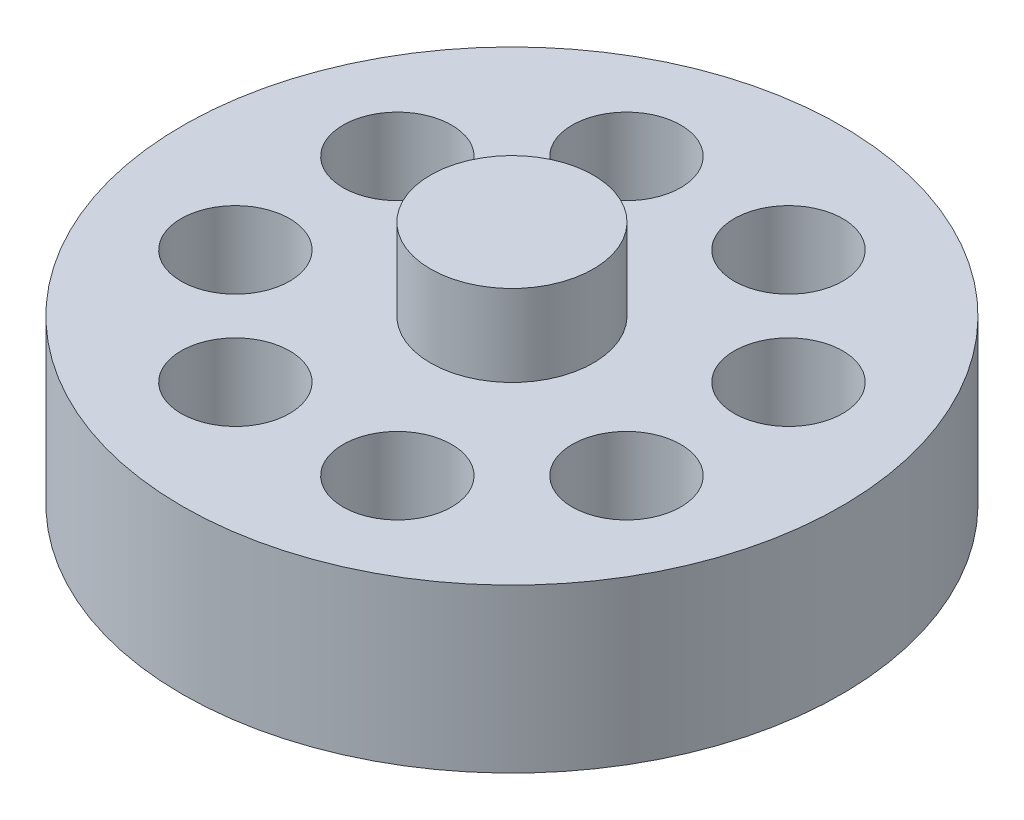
from build123d import *

# Parameters (mm, degrees)
SKETCH1_R           = 60.725
EXTRUDE1_DEPTH      = 15
SKETCH3_R           = 10
CUT_EXTRUDE2_DEPTH  = 88.178272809
EXTRUDE2_DEPTH      = 30
EXTRUDE2_DEPTH_BACK = 30
SKETCH2_R           = 15
CIRPATTERN1_COUNT   = 8


with BuildPart() as part:
    # Sketch1 → Extrude1 (new, symmetric)
    with BuildSketch(Plane(origin=(0, 0, 0), x_dir=(1, 0, 0), z_dir=(0, 1, 0))):
        with Locations(Location((0, 0, 0), (0, 0, 270))):
            Circle(SKETCH1_R)
    extrude(amount=EXTRUDE1_DEPTH, both=True)

    # Sketch3 → Cut-Extrude2 (cut, symmetric)
    with BuildSketch(Plane(origin=(0, 0, 0), x_dir=(1, 0, 0), z_dir=(0, 1, 0))):
        with Locations(Location((-14.924653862, 36.031301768, 0), (0, 0, 270))):
            Circle(SKETCH3_R)
    cut_extrude2 = extrude(amount=CUT_EXTRUDE2_DEPTH, both=True, mode=Mode.SUBTRACT)

    # Sketch2 → Extrude2 (add, two sides: drawn at the far end of the back side and taken through both)
    with BuildSketch(Plane(origin=(0, 0, 0), x_dir=(1, 0, 0), z_dir=(0, 1, 0)).offset(-EXTRUDE2_DEPTH_BACK)):
        with Locations(Location((0, 0, 0), (0, 0, 270))):
            Circle(SKETCH2_R)
    extrude(amount=EXTRUDE2_DEPTH + EXTRUDE2_DEPTH_BACK)

    # CirPattern1: Cut-Extrude2 ×8 about axis
    cirpattern1_axis = Axis((0, 0, 0), (0, 1, 0))
    for i in range(1, CIRPATTERN1_COUNT):
        add(cut_extrude2.rotate(cirpattern1_axis, i * 360 / CIRPATTERN1_COUNT), mode=Mode.SUBTRACT)


solid = part.part
